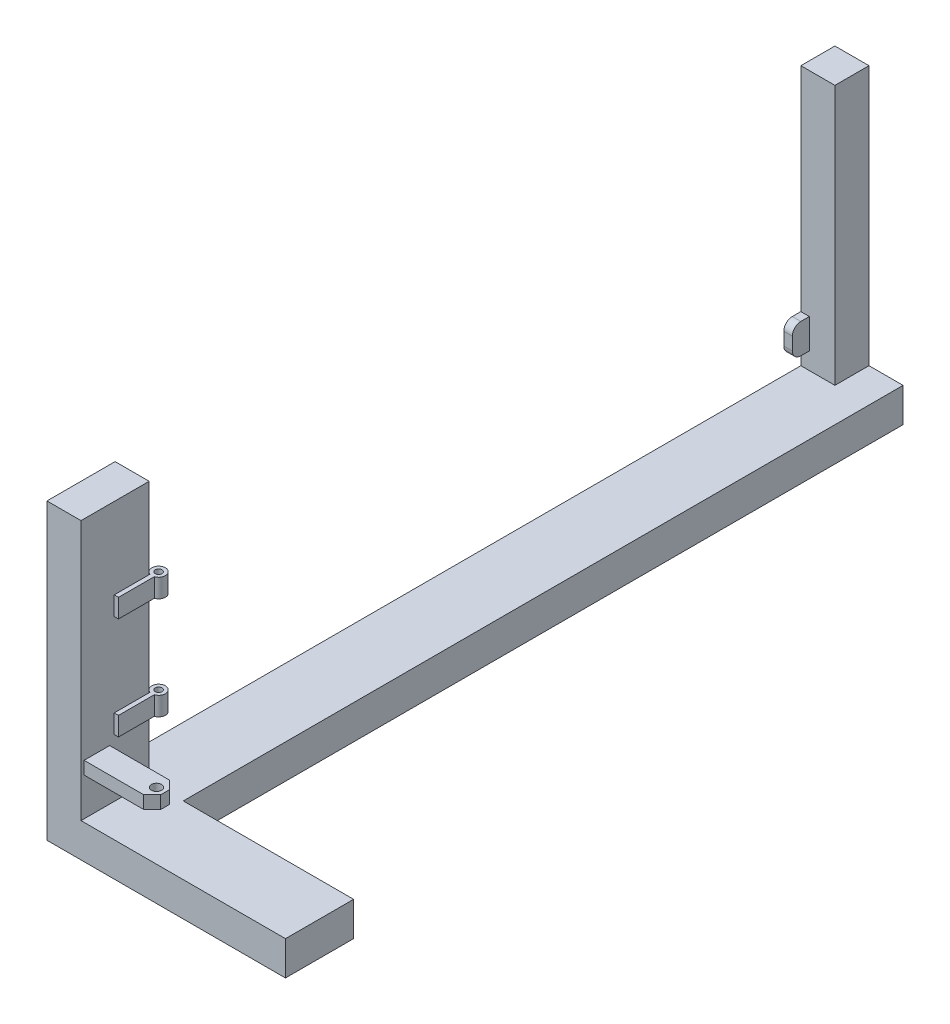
ISO-10303-21;
HEADER;
FILE_DESCRIPTION(('STEP AP214'),'2;1');
FILE_NAME('part.step','',(''),(''),'','','');
FILE_SCHEMA(('AUTOMOTIVE_DESIGN { 1 0 10303 214 1 1 1 1 }'));
ENDSEC;
DATA;
#1=APPLICATION_CONTEXT('core data for automotive mechanical design processes');
#2=APPLICATION_PROTOCOL_DEFINITION('international standard','automotive_design',2000,#1);
#3=PRODUCT_CONTEXT('',#1,'mechanical');
#4=PRODUCT('Part','Part','',(#3));
#5=PRODUCT_RELATED_PRODUCT_CATEGORY('part','',(#4));
#6=PRODUCT_DEFINITION_FORMATION('','',#4);
#7=PRODUCT_DEFINITION_CONTEXT('part definition',#1,'design');
#8=PRODUCT_DEFINITION('design','',#6,#7);
#9=PRODUCT_DEFINITION_SHAPE('','',#8);
#10=(LENGTH_UNIT() NAMED_UNIT(*) SI_UNIT(.MILLI.,.METRE.));
#11=(NAMED_UNIT(*) PLANE_ANGLE_UNIT() SI_UNIT($,.RADIAN.));
#12=(NAMED_UNIT(*) SI_UNIT($,.STERADIAN.) SOLID_ANGLE_UNIT());
#13=UNCERTAINTY_MEASURE_WITH_UNIT(LENGTH_MEASURE(1.E-05),#10,'distance_accuracy_value','');
#14=(GEOMETRIC_REPRESENTATION_CONTEXT(3) GLOBAL_UNCERTAINTY_ASSIGNED_CONTEXT((#13)) GLOBAL_UNIT_ASSIGNED_CONTEXT((#10,
#11,#12)) REPRESENTATION_CONTEXT('',''));
#15=CARTESIAN_POINT('',(0.,0.,0.));
#16=DIRECTION('',(0.,0.,1.));
#17=DIRECTION('',(1.,0.,0.));
#18=AXIS2_PLACEMENT_3D('',#15,#16,#17);
#19=CARTESIAN_POINT('',(40.,345.,925.));
#20=DIRECTION('',(-1.,0.,0.));
#21=DIRECTION('',(0.,0.,1.));
#22=AXIS2_PLACEMENT_3D('',#19,#20,#21);
#23=PLANE('',#22);
#24=DIRECTION('',(0.,0.,-1.));
#25=VECTOR('',#24,1.);
#26=CARTESIAN_POINT('',(40.,108.,886.));
#27=LINE('',#26,#25);
#28=CARTESIAN_POINT('',(40.,108.,886.));
#29=VERTEX_POINT('',#28);
#30=CARTESIAN_POINT('',(40.,108.,845.));
#31=VERTEX_POINT('',#30);
#32=EDGE_CURVE('E336',#29,#31,#27,.T.);
#33=ORIENTED_EDGE('',*,*,#32,.F.);
#34=DIRECTION('',(0.,-1.,0.));
#35=VECTOR('',#34,1.);
#36=CARTESIAN_POINT('',(40.,130.,886.));
#37=LINE('',#36,#35);
#38=CARTESIAN_POINT('',(40.,130.,886.));
#39=VERTEX_POINT('',#38);
#40=EDGE_CURVE('E332',#39,#29,#37,.T.);
#41=ORIENTED_EDGE('',*,*,#40,.F.);
#42=DIRECTION('',(0.,0.,1.));
#43=VECTOR('',#42,1.);
#44=CARTESIAN_POINT('',(40.,130.,886.));
#45=LINE('',#44,#43);
#46=CARTESIAN_POINT('',(40.,130.,845.));
#47=VERTEX_POINT('',#46);
#48=EDGE_CURVE('E340',#47,#39,#45,.T.);
#49=ORIENTED_EDGE('',*,*,#48,.F.);
#50=DIRECTION('',(0.,-1.,0.));
#51=VECTOR('',#50,1.);
#52=CARTESIAN_POINT('',(40.,345.,845.));
#53=LINE('',#52,#51);
#54=CARTESIAN_POINT('',(40.,228.,845.));
#55=VERTEX_POINT('',#54);
#56=EDGE_CURVE('E596',#55,#47,#53,.T.);
#57=ORIENTED_EDGE('',*,*,#56,.F.);
#58=DIRECTION('',(0.,0.,-1.));
#59=VECTOR('',#58,1.);
#60=CARTESIAN_POINT('',(40.,228.,886.));
#61=LINE('',#60,#59);
#62=CARTESIAN_POINT('',(40.,228.,886.));
#63=VERTEX_POINT('',#62);
#64=EDGE_CURVE('E364',#63,#55,#61,.T.);
#65=ORIENTED_EDGE('',*,*,#64,.F.);
#66=DIRECTION('',(0.,-1.,0.));
#67=VECTOR('',#66,1.);
#68=CARTESIAN_POINT('',(40.,250.,886.));
#69=LINE('',#68,#67);
#70=CARTESIAN_POINT('',(40.,250.,886.));
#71=VERTEX_POINT('',#70);
#72=EDGE_CURVE('E360',#71,#63,#69,.T.);
#73=ORIENTED_EDGE('',*,*,#72,.F.);
#74=DIRECTION('',(0.,0.,1.));
#75=VECTOR('',#74,1.);
#76=CARTESIAN_POINT('',(40.,250.,886.));
#77=LINE('',#76,#75);
#78=CARTESIAN_POINT('',(40.,250.,845.));
#79=VERTEX_POINT('',#78);
#80=EDGE_CURVE('E368',#79,#71,#77,.T.);
#81=ORIENTED_EDGE('',*,*,#80,.F.);
#82=CARTESIAN_POINT('',(40.,345.,845.));
#83=VERTEX_POINT('',#82);
#84=EDGE_CURVE('E583',#83,#79,#53,.T.);
#85=ORIENTED_EDGE('',*,*,#84,.F.);
#86=DIRECTION('',(0.,0.,-1.));
#87=VECTOR('',#86,1.);
#88=CARTESIAN_POINT('',(40.,345.,925.));
#89=LINE('',#88,#87);
#90=CARTESIAN_POINT('',(40.,345.,925.));
#91=VERTEX_POINT('',#90);
#92=EDGE_CURVE('E670',#91,#83,#89,.T.);
#93=ORIENTED_EDGE('',*,*,#92,.F.);
#94=DIRECTION('',(0.,-1.,0.));
#95=VECTOR('',#94,1.);
#96=CARTESIAN_POINT('',(40.,345.,925.));
#97=LINE('',#96,#95);
#98=CARTESIAN_POINT('',(40.,40.,925.));
#99=VERTEX_POINT('',#98);
#100=EDGE_CURVE('E580',#91,#99,#97,.T.);
#101=ORIENTED_EDGE('',*,*,#100,.T.);
#102=DIRECTION('',(0.,0.,-1.));
#103=VECTOR('',#102,1.);
#104=CARTESIAN_POINT('',(40.,40.,925.));
#105=LINE('',#104,#103);
#106=CARTESIAN_POINT('',(40.,40.,845.));
#107=VERTEX_POINT('',#106);
#108=EDGE_CURVE('E414',#99,#107,#105,.T.);
#109=ORIENTED_EDGE('',*,*,#108,.T.);
#110=EDGE_CURVE('E429',#31,#107,#53,.T.);
#111=ORIENTED_EDGE('',*,*,#110,.F.);
#112=EDGE_LOOP('',(#33,#41,#49,#57,#65,#73,#81,#85,#93,#101,#109,#111));
#113=FACE_BOUND('',#112,.T.);
#114=DIRECTION('',(0.,-1.,0.));
#115=VECTOR('',#114,1.);
#116=CARTESIAN_POINT('',(40.,99.5,921.400657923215));
#117=LINE('',#116,#115);
#118=CARTESIAN_POINT('',(40.,99.5,921.400657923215));
#119=VERTEX_POINT('',#118);
#120=CARTESIAN_POINT('',(40.,84.5,921.400657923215));
#121=VERTEX_POINT('',#120);
#122=EDGE_CURVE('E255',#119,#121,#117,.T.);
#123=ORIENTED_EDGE('',*,*,#122,.F.);
#124=DIRECTION('',(0.,0.,1.));
#125=VECTOR('',#124,1.);
#126=CARTESIAN_POINT('',(40.,99.5,921.400657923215));
#127=LINE('',#126,#125);
#128=CARTESIAN_POINT('',(40.,99.5,891.400657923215));
#129=VERTEX_POINT('',#128);
#130=EDGE_CURVE('E265',#129,#119,#127,.T.);
#131=ORIENTED_EDGE('',*,*,#130,.F.);
#132=DIRECTION('',(0.,1.,0.));
#133=VECTOR('',#132,1.);
#134=CARTESIAN_POINT('',(40.,99.5,891.400657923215));
#135=LINE('',#134,#133);
#136=CARTESIAN_POINT('',(40.,84.5,891.400657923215));
#137=VERTEX_POINT('',#136);
#138=EDGE_CURVE('E273',#137,#129,#135,.T.);
#139=ORIENTED_EDGE('',*,*,#138,.F.);
#140=DIRECTION('',(0.,0.,-1.));
#141=VECTOR('',#140,1.);
#142=CARTESIAN_POINT('',(40.,84.5,921.400657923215));
#143=LINE('',#142,#141);
#144=EDGE_CURVE('E268',#121,#137,#143,.T.);
#145=ORIENTED_EDGE('',*,*,#144,.F.);
#146=EDGE_LOOP('',(#123,#131,#139,#145));
#147=FACE_BOUND('',#146,.T.);
#148=ADVANCED_FACE('F33',(#113,#147),#23,.F.);
#149=CARTESIAN_POINT('',(0.,345.,40.));
#150=DIRECTION('',(0.,0.,-1.));
#151=DIRECTION('',(-1.,0.,0.));
#152=AXIS2_PLACEMENT_3D('',#149,#150,#151);
#153=PLANE('',#152);
#154=DIRECTION('',(1.,0.,0.));
#155=VECTOR('',#154,1.);
#156=CARTESIAN_POINT('',(0.,60.,40.));
#157=LINE('',#156,#155);
#158=CARTESIAN_POINT('',(0.,60.,40.));
#159=VERTEX_POINT('',#158);
#160=CARTESIAN_POINT('',(10.,59.9999999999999,40.));
#161=VERTEX_POINT('',#160);
#162=EDGE_CURVE('E287',#159,#161,#157,.T.);
#163=ORIENTED_EDGE('',*,*,#162,.F.);
#164=DIRECTION('',(0.,-1.,0.));
#165=VECTOR('',#164,1.);
#166=CARTESIAN_POINT('',(0.,345.,40.));
#167=LINE('',#166,#165);
#168=CARTESIAN_POINT('',(0.,40.,40.0000000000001));
#169=VERTEX_POINT('',#168);
#170=EDGE_CURVE('E410',#159,#169,#167,.T.);
#171=ORIENTED_EDGE('',*,*,#170,.T.);
#172=DIRECTION('',(1.,0.,0.));
#173=VECTOR('',#172,1.);
#174=CARTESIAN_POINT('',(0.,40.,40.));
#175=LINE('',#174,#173);
#176=CARTESIAN_POINT('',(40.,40.,39.9999999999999));
#177=VERTEX_POINT('',#176);
#178=EDGE_CURVE('E388',#169,#177,#175,.T.);
#179=ORIENTED_EDGE('',*,*,#178,.T.);
#180=DIRECTION('',(0.,-1.,0.));
#181=VECTOR('',#180,1.);
#182=CARTESIAN_POINT('',(40.,345.,40.));
#183=LINE('',#182,#181);
#184=CARTESIAN_POINT('',(40.,345.,40.));
#185=VERTEX_POINT('',#184);
#186=EDGE_CURVE('E407',#185,#177,#183,.T.);
#187=ORIENTED_EDGE('',*,*,#186,.F.);
#188=DIRECTION('',(1.,0.,0.));
#189=VECTOR('',#188,1.);
#190=CARTESIAN_POINT('',(0.,345.,40.));
#191=LINE('',#190,#189);
#192=CARTESIAN_POINT('',(0.,345.,40.));
#193=VERTEX_POINT('',#192);
#194=EDGE_CURVE('E397',#193,#185,#191,.T.);
#195=ORIENTED_EDGE('',*,*,#194,.F.);
#196=CARTESIAN_POINT('',(0.,95.,40.));
#197=VERTEX_POINT('',#196);
#198=EDGE_CURVE('E411',#193,#197,#167,.T.);
#199=ORIENTED_EDGE('',*,*,#198,.T.);
#200=DIRECTION('',(-1.,0.,0.));
#201=VECTOR('',#200,1.);
#202=CARTESIAN_POINT('',(0.,95.,40.));
#203=LINE('',#202,#201);
#204=CARTESIAN_POINT('',(10.,95.,40.));
#205=VERTEX_POINT('',#204);
#206=EDGE_CURVE('E293',#205,#197,#203,.T.);
#207=ORIENTED_EDGE('',*,*,#206,.F.);
#208=DIRECTION('',(0.,1.,0.));
#209=VECTOR('',#208,1.);
#210=CARTESIAN_POINT('',(10.,60.,40.));
#211=LINE('',#210,#209);
#212=EDGE_CURVE('E290',#161,#205,#211,.T.);
#213=ORIENTED_EDGE('',*,*,#212,.F.);
#214=EDGE_LOOP('',(#163,#171,#179,#187,#195,#199,#207,#213));
#215=FACE_BOUND('',#214,.T.);
#216=ADVANCED_FACE('F498',(#215),#153,.F.);
#217=CARTESIAN_POINT('',(0.,40.,925.));
#218=DIRECTION('',(0.,-1.,0.));
#219=DIRECTION('',(1.,0.,0.));
#220=AXIS2_PLACEMENT_3D('',#217,#218,#219);
#221=PLANE('',#220);
#222=ORIENTED_EDGE('',*,*,#178,.F.);
#223=DIRECTION('',(0.,0.,-1.));
#224=VECTOR('',#223,1.);
#225=CARTESIAN_POINT('',(0.,40.,925.));
#226=LINE('',#225,#224);
#227=CARTESIAN_POINT('',(0.,40.,845.));
#228=VERTEX_POINT('',#227);
#229=EDGE_CURVE('E575',#228,#169,#226,.T.);
#230=ORIENTED_EDGE('',*,*,#229,.F.);
#231=DIRECTION('',(-1.,0.,0.));
#232=VECTOR('',#231,1.);
#233=CARTESIAN_POINT('',(0.,40.,845.));
#234=LINE('',#233,#232);
#235=EDGE_CURVE('E420',#107,#228,#234,.T.);
#236=ORIENTED_EDGE('',*,*,#235,.F.);
#237=ORIENTED_EDGE('',*,*,#108,.F.);
#238=DIRECTION('',(-1.,0.,0.));
#239=VECTOR('',#238,1.);
#240=CARTESIAN_POINT('',(0.,40.,925.));
#241=LINE('',#240,#239);
#242=CARTESIAN_POINT('',(280.,40.,925.));
#243=VERTEX_POINT('',#242);
#244=EDGE_CURVE('E566',#243,#99,#241,.T.);
#245=ORIENTED_EDGE('',*,*,#244,.F.);
#246=DIRECTION('',(0.,0.,1.));
#247=VECTOR('',#246,1.);
#248=CARTESIAN_POINT('',(280.,40.,925.));
#249=LINE('',#248,#247);
#250=CARTESIAN_POINT('',(280.,40.,845.));
#251=VERTEX_POINT('',#250);
#252=EDGE_CURVE('E643',#251,#243,#249,.T.);
#253=ORIENTED_EDGE('',*,*,#252,.F.);
#254=DIRECTION('',(-1.,0.,0.));
#255=VECTOR('',#254,1.);
#256=CARTESIAN_POINT('',(280.,40.,845.));
#257=LINE('',#256,#255);
#258=CARTESIAN_POINT('',(80.,40.,845.));
#259=VERTEX_POINT('',#258);
#260=EDGE_CURVE('E644',#251,#259,#257,.T.);
#261=ORIENTED_EDGE('',*,*,#260,.T.);
#262=DIRECTION('',(0.,0.,-1.));
#263=VECTOR('',#262,1.);
#264=CARTESIAN_POINT('',(80.,40.,925.));
#265=LINE('',#264,#263);
#266=CARTESIAN_POINT('',(80.,40.,0.));
#267=VERTEX_POINT('',#266);
#268=EDGE_CURVE('E657',#259,#267,#265,.T.);
#269=ORIENTED_EDGE('',*,*,#268,.T.);
#270=DIRECTION('',(-1.,0.,0.));
#271=VECTOR('',#270,1.);
#272=CARTESIAN_POINT('',(0.,40.,0.));
#273=LINE('',#272,#271);
#274=CARTESIAN_POINT('',(40.,40.,0.));
#275=VERTEX_POINT('',#274);
#276=EDGE_CURVE('E556',#267,#275,#273,.T.);
#277=ORIENTED_EDGE('',*,*,#276,.T.);
#278=DIRECTION('',(0.,0.,-1.));
#279=VECTOR('',#278,1.);
#280=CARTESIAN_POINT('',(40.,40.,0.));
#281=LINE('',#280,#279);
#282=EDGE_CURVE('E391',#177,#275,#281,.T.);
#283=ORIENTED_EDGE('',*,*,#282,.F.);
#284=EDGE_LOOP('',(#222,#230,#236,#237,#245,#253,#261,#269,#277,#283));
#285=FACE_BOUND('',#284,.T.);
#286=ADVANCED_FACE('F504',(#285),#221,.F.);
#287=CARTESIAN_POINT('',(80.,0.,925.));
#288=DIRECTION('',(-1.,0.,0.));
#289=DIRECTION('',(0.,0.,1.));
#290=AXIS2_PLACEMENT_3D('',#287,#288,#289);
#291=PLANE('',#290);
#292=DIRECTION('',(0.,1.,0.));
#293=VECTOR('',#292,1.);
#294=CARTESIAN_POINT('',(80.,40.,845.));
#295=LINE('',#294,#293);
#296=CARTESIAN_POINT('',(80.,0.,845.));
#297=VERTEX_POINT('',#296);
#298=EDGE_CURVE('E582',#297,#259,#295,.T.);
#299=ORIENTED_EDGE('',*,*,#298,.F.);
#300=DIRECTION('',(0.,0.,-1.));
#301=VECTOR('',#300,1.);
#302=CARTESIAN_POINT('',(80.,0.,925.));
#303=LINE('',#302,#301);
#304=CARTESIAN_POINT('',(80.,0.,0.));
#305=VERTEX_POINT('',#304);
#306=EDGE_CURVE('E547',#297,#305,#303,.T.);
#307=ORIENTED_EDGE('',*,*,#306,.T.);
#308=DIRECTION('',(0.,1.,0.));
#309=VECTOR('',#308,1.);
#310=CARTESIAN_POINT('',(80.,0.,0.));
#311=LINE('',#310,#309);
#312=EDGE_CURVE('E551',#305,#267,#311,.T.);
#313=ORIENTED_EDGE('',*,*,#312,.T.);
#314=ORIENTED_EDGE('',*,*,#268,.F.);
#315=EDGE_LOOP('',(#299,#307,#313,#314));
#316=FACE_BOUND('',#315,.T.);
#317=ADVANCED_FACE('F531',(#316),#291,.F.);
#318=CARTESIAN_POINT('',(0.,0.,925.));
#319=DIRECTION('',(1.,0.,0.));
#320=DIRECTION('',(0.,0.,-1.));
#321=AXIS2_PLACEMENT_3D('',#318,#319,#320);
#322=PLANE('',#321);
#323=DIRECTION('',(0.,-1.,0.));
#324=VECTOR('',#323,1.);
#325=CARTESIAN_POINT('',(0.,60.,60.));
#326=LINE('',#325,#324);
#327=CARTESIAN_POINT('',(0.,85.,60.));
#328=VERTEX_POINT('',#327);
#329=CARTESIAN_POINT('',(0.,70.,60.));
#330=VERTEX_POINT('',#329);
#331=EDGE_CURVE('E296',#328,#330,#326,.T.);
#332=ORIENTED_EDGE('',*,*,#331,.F.);
#333=CARTESIAN_POINT('',(0.,85.,50.));
#334=DIRECTION('',(1.,0.,0.));
#335=DIRECTION('',(0.,0.,-1.));
#336=AXIS2_PLACEMENT_3D('',#333,#334,#335);
#337=CIRCLE('',#336,10.);
#338=CARTESIAN_POINT('',(0.,95.,50.));
#339=VERTEX_POINT('',#338);
#340=EDGE_CURVE('E442',#328,#339,#337,.F.);
#341=ORIENTED_EDGE('',*,*,#340,.T.);
#342=DIRECTION('',(0.,0.,-1.));
#343=VECTOR('',#342,1.);
#344=CARTESIAN_POINT('',(0.,95.,60.));
#345=LINE('',#344,#343);
#346=EDGE_CURVE('E302',#339,#197,#345,.T.);
#347=ORIENTED_EDGE('',*,*,#346,.T.);
#348=ORIENTED_EDGE('',*,*,#198,.F.);
#349=DIRECTION('',(0.,0.,1.));
#350=VECTOR('',#349,1.);
#351=CARTESIAN_POINT('',(0.,345.,0.));
#352=LINE('',#351,#350);
#353=CARTESIAN_POINT('',(0.,345.,0.));
#354=VERTEX_POINT('',#353);
#355=EDGE_CURVE('E394',#354,#193,#352,.T.);
#356=ORIENTED_EDGE('',*,*,#355,.F.);
#357=DIRECTION('',(0.,-1.,0.));
#358=VECTOR('',#357,1.);
#359=CARTESIAN_POINT('',(0.,0.,0.));
#360=LINE('',#359,#358);
#361=CARTESIAN_POINT('',(0.,0.,0.));
#362=VERTEX_POINT('',#361);
#363=EDGE_CURVE('E552',#354,#362,#360,.T.);
#364=ORIENTED_EDGE('',*,*,#363,.T.);
#365=DIRECTION('',(0.,0.,-1.));
#366=VECTOR('',#365,1.);
#367=CARTESIAN_POINT('',(0.,0.,925.));
#368=LINE('',#367,#366);
#369=CARTESIAN_POINT('',(0.,0.,925.));
#370=VERTEX_POINT('',#369);
#371=EDGE_CURVE('E437',#370,#362,#368,.T.);
#372=ORIENTED_EDGE('',*,*,#371,.F.);
#373=DIRECTION('',(0.,-1.,0.));
#374=VECTOR('',#373,1.);
#375=CARTESIAN_POINT('',(0.,0.,925.));
#376=LINE('',#375,#374);
#377=CARTESIAN_POINT('',(0.,345.,925.));
#378=VERTEX_POINT('',#377);
#379=EDGE_CURVE('E558',#378,#370,#376,.T.);
#380=ORIENTED_EDGE('',*,*,#379,.F.);
#381=DIRECTION('',(0.,0.,1.));
#382=VECTOR('',#381,1.);
#383=CARTESIAN_POINT('',(0.,345.,925.));
#384=LINE('',#383,#382);
#385=CARTESIAN_POINT('',(0.,345.,845.));
#386=VERTEX_POINT('',#385);
#387=EDGE_CURVE('E417',#386,#378,#384,.T.);
#388=ORIENTED_EDGE('',*,*,#387,.F.);
#389=DIRECTION('',(0.,-1.,0.));
#390=VECTOR('',#389,1.);
#391=CARTESIAN_POINT('',(0.,345.,845.));
#392=LINE('',#391,#390);
#393=EDGE_CURVE('E426',#386,#228,#392,.T.);
#394=ORIENTED_EDGE('',*,*,#393,.T.);
#395=ORIENTED_EDGE('',*,*,#229,.T.);
#396=ORIENTED_EDGE('',*,*,#170,.F.);
#397=DIRECTION('',(0.,0.,-1.));
#398=VECTOR('',#397,1.);
#399=CARTESIAN_POINT('',(0.,60.,60.));
#400=LINE('',#399,#398);
#401=CARTESIAN_POINT('',(0.,60.,50.));
#402=VERTEX_POINT('',#401);
#403=EDGE_CURVE('E308',#402,#159,#400,.T.);
#404=ORIENTED_EDGE('',*,*,#403,.F.);
#405=CARTESIAN_POINT('',(0.,70.,50.));
#406=DIRECTION('',(1.,0.,0.));
#407=DIRECTION('',(0.,0.,-1.));
#408=AXIS2_PLACEMENT_3D('',#405,#406,#407);
#409=CIRCLE('',#408,10.);
#410=EDGE_CURVE('E440',#402,#330,#409,.F.);
#411=ORIENTED_EDGE('',*,*,#410,.T.);
#412=EDGE_LOOP('',(#332,#341,#347,#348,#356,#364,#372,#380,#388,#394,#395,#396,#404,#411));
#413=FACE_BOUND('',#412,.T.);
#414=ADVANCED_FACE('F35',(#413),#322,.F.);
#415=CARTESIAN_POINT('',(0.,0.,925.));
#416=DIRECTION('',(0.,1.,0.));
#417=DIRECTION('',(-1.,0.,0.));
#418=AXIS2_PLACEMENT_3D('',#415,#416,#417);
#419=PLANE('',#418);
#420=DIRECTION('',(1.,0.,0.));
#421=VECTOR('',#420,1.);
#422=CARTESIAN_POINT('',(0.,0.,0.));
#423=LINE('',#422,#421);
#424=EDGE_CURVE('E544',#362,#305,#423,.T.);
#425=ORIENTED_EDGE('',*,*,#424,.T.);
#426=ORIENTED_EDGE('',*,*,#306,.F.);
#427=DIRECTION('',(-1.,0.,0.));
#428=VECTOR('',#427,1.);
#429=CARTESIAN_POINT('',(280.,0.,845.));
#430=LINE('',#429,#428);
#431=CARTESIAN_POINT('',(280.,0.,845.));
#432=VERTEX_POINT('',#431);
#433=EDGE_CURVE('E645',#432,#297,#430,.T.);
#434=ORIENTED_EDGE('',*,*,#433,.F.);
#435=DIRECTION('',(0.,0.,-1.));
#436=VECTOR('',#435,1.);
#437=CARTESIAN_POINT('',(280.,0.,925.));
#438=LINE('',#437,#436);
#439=CARTESIAN_POINT('',(280.,0.,925.));
#440=VERTEX_POINT('',#439);
#441=EDGE_CURVE('E636',#440,#432,#438,.T.);
#442=ORIENTED_EDGE('',*,*,#441,.F.);
#443=DIRECTION('',(1.,0.,0.));
#444=VECTOR('',#443,1.);
#445=CARTESIAN_POINT('',(0.,0.,925.));
#446=LINE('',#445,#444);
#447=EDGE_CURVE('E564',#370,#440,#446,.T.);
#448=ORIENTED_EDGE('',*,*,#447,.F.);
#449=ORIENTED_EDGE('',*,*,#371,.T.);
#450=EDGE_LOOP('',(#425,#426,#434,#442,#448,#449));
#451=FACE_BOUND('',#450,.T.);
#452=ADVANCED_FACE('F527',(#451),#419,.F.);
#453=CARTESIAN_POINT('',(0.,40.,925.));
#454=DIRECTION('',(0.,0.,-1.));
#455=DIRECTION('',(-1.,0.,0.));
#456=AXIS2_PLACEMENT_3D('',#453,#454,#455);
#457=PLANE('',#456);
#458=ORIENTED_EDGE('',*,*,#379,.T.);
#459=ORIENTED_EDGE('',*,*,#447,.T.);
#460=DIRECTION('',(0.,-1.,0.));
#461=VECTOR('',#460,1.);
#462=CARTESIAN_POINT('',(280.,40.,925.));
#463=LINE('',#462,#461);
#464=EDGE_CURVE('E587',#243,#440,#463,.T.);
#465=ORIENTED_EDGE('',*,*,#464,.F.);
#466=ORIENTED_EDGE('',*,*,#244,.T.);
#467=ORIENTED_EDGE('',*,*,#100,.F.);
#468=DIRECTION('',(1.,0.,0.));
#469=VECTOR('',#468,1.);
#470=CARTESIAN_POINT('',(0.,345.,925.));
#471=LINE('',#470,#469);
#472=EDGE_CURVE('E669',#378,#91,#471,.T.);
#473=ORIENTED_EDGE('',*,*,#472,.F.);
#474=EDGE_LOOP('',(#458,#459,#465,#466,#467,#473));
#475=FACE_BOUND('',#474,.T.);
#476=ADVANCED_FACE('F523',(#475),#457,.F.);
#477=CARTESIAN_POINT('',(0.,40.,0.));
#478=DIRECTION('',(0.,0.,-1.));
#479=DIRECTION('',(-1.,0.,0.));
#480=AXIS2_PLACEMENT_3D('',#477,#478,#479);
#481=PLANE('',#480);
#482=ORIENTED_EDGE('',*,*,#363,.F.);
#483=DIRECTION('',(-1.,0.,0.));
#484=VECTOR('',#483,1.);
#485=CARTESIAN_POINT('',(0.,345.,0.));
#486=LINE('',#485,#484);
#487=CARTESIAN_POINT('',(40.,345.,0.));
#488=VERTEX_POINT('',#487);
#489=EDGE_CURVE('E401',#488,#354,#486,.T.);
#490=ORIENTED_EDGE('',*,*,#489,.F.);
#491=DIRECTION('',(0.,-1.,0.));
#492=VECTOR('',#491,1.);
#493=CARTESIAN_POINT('',(40.,345.,0.));
#494=LINE('',#493,#492);
#495=EDGE_CURVE('E404',#488,#275,#494,.T.);
#496=ORIENTED_EDGE('',*,*,#495,.T.);
#497=ORIENTED_EDGE('',*,*,#276,.F.);
#498=ORIENTED_EDGE('',*,*,#312,.F.);
#499=ORIENTED_EDGE('',*,*,#424,.F.);
#500=EDGE_LOOP('',(#482,#490,#496,#497,#498,#499));
#501=FACE_BOUND('',#500,.T.);
#502=ADVANCED_FACE('F519',(#501),#481,.T.);
#503=CARTESIAN_POINT('',(280.,40.,845.));
#504=DIRECTION('',(0.,0.,1.));
#505=DIRECTION('',(1.,0.,0.));
#506=AXIS2_PLACEMENT_3D('',#503,#504,#505);
#507=PLANE('',#506);
#508=ORIENTED_EDGE('',*,*,#298,.T.);
#509=ORIENTED_EDGE('',*,*,#260,.F.);
#510=DIRECTION('',(0.,1.,0.));
#511=VECTOR('',#510,1.);
#512=CARTESIAN_POINT('',(280.,40.,845.));
#513=LINE('',#512,#511);
#514=EDGE_CURVE('E638',#432,#251,#513,.T.);
#515=ORIENTED_EDGE('',*,*,#514,.F.);
#516=ORIENTED_EDGE('',*,*,#433,.T.);
#517=EDGE_LOOP('',(#508,#509,#515,#516));
#518=FACE_BOUND('',#517,.T.);
#519=ADVANCED_FACE('F515',(#518),#507,.F.);
#520=CARTESIAN_POINT('',(280.,0.,925.));
#521=DIRECTION('',(1.,0.,0.));
#522=DIRECTION('',(0.,0.,-1.));
#523=AXIS2_PLACEMENT_3D('',#520,#521,#522);
#524=PLANE('',#523);
#525=ORIENTED_EDGE('',*,*,#464,.T.);
#526=ORIENTED_EDGE('',*,*,#441,.T.);
#527=ORIENTED_EDGE('',*,*,#514,.T.);
#528=ORIENTED_EDGE('',*,*,#252,.T.);
#529=EDGE_LOOP('',(#525,#526,#527,#528));
#530=FACE_BOUND('',#529,.T.);
#531=ADVANCED_FACE('F512',(#530),#524,.T.);
#532=CARTESIAN_POINT('',(0.,345.,845.));
#533=DIRECTION('',(0.,0.,1.));
#534=DIRECTION('',(1.,0.,0.));
#535=AXIS2_PLACEMENT_3D('',#532,#533,#534);
#536=PLANE('',#535);
#537=ORIENTED_EDGE('',*,*,#235,.T.);
#538=ORIENTED_EDGE('',*,*,#393,.F.);
#539=DIRECTION('',(-1.,0.,0.));
#540=VECTOR('',#539,1.);
#541=CARTESIAN_POINT('',(0.,345.,845.));
#542=LINE('',#541,#540);
#543=EDGE_CURVE('E430',#83,#386,#542,.T.);
#544=ORIENTED_EDGE('',*,*,#543,.F.);
#545=ORIENTED_EDGE('',*,*,#84,.T.);
#546=EDGE_CURVE('E590',#79,#55,#53,.T.);
#547=ORIENTED_EDGE('',*,*,#546,.T.);
#548=ORIENTED_EDGE('',*,*,#56,.T.);
#549=EDGE_CURVE('E599',#47,#31,#53,.T.);
#550=ORIENTED_EDGE('',*,*,#549,.T.);
#551=ORIENTED_EDGE('',*,*,#110,.T.);
#552=EDGE_LOOP('',(#537,#538,#544,#545,#547,#548,#550,#551));
#553=FACE_BOUND('',#552,.T.);
#554=ADVANCED_FACE('F510',(#553),#536,.F.);
#555=CARTESIAN_POINT('',(0.,345.,845.));
#556=DIRECTION('',(0.,-1.,0.));
#557=DIRECTION('',(1.,0.,0.));
#558=AXIS2_PLACEMENT_3D('',#555,#556,#557);
#559=PLANE('',#558);
#560=ORIENTED_EDGE('',*,*,#387,.T.);
#561=ORIENTED_EDGE('',*,*,#472,.T.);
#562=ORIENTED_EDGE('',*,*,#92,.T.);
#563=ORIENTED_EDGE('',*,*,#543,.T.);
#564=EDGE_LOOP('',(#560,#561,#562,#563));
#565=FACE_BOUND('',#564,.T.);
#566=ADVANCED_FACE('F672',(#565),#559,.F.);
#567=CARTESIAN_POINT('',(40.,345.,0.));
#568=DIRECTION('',(-1.,0.,0.));
#569=DIRECTION('',(0.,-1.,0.));
#570=AXIS2_PLACEMENT_3D('',#567,#568,#569);
#571=PLANE('',#570);
#572=ORIENTED_EDGE('',*,*,#282,.T.);
#573=ORIENTED_EDGE('',*,*,#495,.F.);
#574=DIRECTION('',(0.,0.,-1.));
#575=VECTOR('',#574,1.);
#576=CARTESIAN_POINT('',(40.,345.,0.));
#577=LINE('',#576,#575);
#578=EDGE_CURVE('E399',#185,#488,#577,.T.);
#579=ORIENTED_EDGE('',*,*,#578,.F.);
#580=ORIENTED_EDGE('',*,*,#186,.T.);
#581=EDGE_LOOP('',(#572,#573,#579,#580));
#582=FACE_BOUND('',#581,.T.);
#583=ADVANCED_FACE('F732',(#582),#571,.F.);
#584=CARTESIAN_POINT('',(0.,345.,0.));
#585=DIRECTION('',(0.,1.,0.));
#586=DIRECTION('',(-1.,0.,0.));
#587=AXIS2_PLACEMENT_3D('',#584,#585,#586);
#588=PLANE('',#587);
#589=ORIENTED_EDGE('',*,*,#355,.T.);
#590=ORIENTED_EDGE('',*,*,#194,.T.);
#591=ORIENTED_EDGE('',*,*,#578,.T.);
#592=ORIENTED_EDGE('',*,*,#489,.T.);
#593=EDGE_LOOP('',(#589,#590,#591,#592));
#594=FACE_BOUND('',#593,.T.);
#595=ADVANCED_FACE('F721',(#594),#588,.T.);
#596=CARTESIAN_POINT('',(40.,228.,886.));
#597=DIRECTION('',(1.,0.,0.));
#598=DIRECTION('',(0.,0.,-1.));
#599=AXIS2_PLACEMENT_3D('',#596,#597,#598);
#600=PLANE('',#599);
#601=CARTESIAN_POINT('',(39.9999999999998,228.,844.));
#602=VERTEX_POINT('',#601);
#603=EDGE_CURVE('E363',#55,#602,#61,.T.);
#604=ORIENTED_EDGE('',*,*,#603,.F.);
#605=ORIENTED_EDGE('',*,*,#546,.F.);
#606=CARTESIAN_POINT('',(40.0000000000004,250.,844.));
#607=VERTEX_POINT('',#606);
#608=EDGE_CURVE('E369',#607,#79,#77,.T.);
#609=ORIENTED_EDGE('',*,*,#608,.F.);
#610=DIRECTION('',(0.,1.,0.));
#611=VECTOR('',#610,1.);
#612=CARTESIAN_POINT('',(40.,250.,844.));
#613=LINE('',#612,#611);
#614=EDGE_CURVE('E366',#602,#607,#613,.T.);
#615=ORIENTED_EDGE('',*,*,#614,.F.);
#616=EDGE_LOOP('',(#604,#605,#609,#615));
#617=FACE_BOUND('',#616,.T.);
#618=ADVANCED_FACE('F690',(#617),#600,.F.);
#619=CARTESIAN_POINT('',(45.,250.,886.));
#620=DIRECTION('',(0.,0.,-1.));
#621=DIRECTION('',(-1.,0.,0.));
#622=AXIS2_PLACEMENT_3D('',#619,#620,#621);
#623=PLANE('',#622);
#624=ORIENTED_EDGE('',*,*,#72,.T.);
#625=DIRECTION('',(-1.,0.,0.));
#626=VECTOR('',#625,1.);
#627=CARTESIAN_POINT('',(45.,228.,886.));
#628=LINE('',#627,#626);
#629=CARTESIAN_POINT('',(45.,228.,886.));
#630=VERTEX_POINT('',#629);
#631=EDGE_CURVE('E386',#630,#63,#628,.T.);
#632=ORIENTED_EDGE('',*,*,#631,.F.);
#633=DIRECTION('',(0.,-1.,0.));
#634=VECTOR('',#633,1.);
#635=CARTESIAN_POINT('',(45.,250.,886.));
#636=LINE('',#635,#634);
#637=CARTESIAN_POINT('',(45.,250.,886.));
#638=VERTEX_POINT('',#637);
#639=EDGE_CURVE('E372',#638,#630,#636,.T.);
#640=ORIENTED_EDGE('',*,*,#639,.F.);
#641=DIRECTION('',(-1.,0.,0.));
#642=VECTOR('',#641,1.);
#643=CARTESIAN_POINT('',(45.,250.,886.));
#644=LINE('',#643,#642);
#645=EDGE_CURVE('E383',#638,#71,#644,.T.);
#646=ORIENTED_EDGE('',*,*,#645,.T.);
#647=EDGE_LOOP('',(#624,#632,#640,#646));
#648=FACE_BOUND('',#647,.T.);
#649=ADVANCED_FACE('F682',(#648),#623,.F.);
#650=CARTESIAN_POINT('',(45.,228.,886.));
#651=DIRECTION('',(0.,1.,0.));
#652=DIRECTION('',(-1.,0.,0.));
#653=AXIS2_PLACEMENT_3D('',#650,#651,#652);
#654=PLANE('',#653);
#655=ORIENTED_EDGE('',*,*,#603,.T.);
#656=CARTESIAN_POINT('',(42.5,228.,836.400657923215));
#657=DIRECTION('',(0.,1.,0.));
#658=DIRECTION('',(-1.,0.,0.));
#659=AXIS2_PLACEMENT_3D('',#656,#657,#658);
#660=CIRCLE('',#659,8.);
#661=CARTESIAN_POINT('',(45.,228.,844.));
#662=VERTEX_POINT('',#661);
#663=EDGE_CURVE('E330',#662,#602,#660,.T.);
#664=ORIENTED_EDGE('',*,*,#663,.F.);
#665=DIRECTION('',(0.,0.,-1.));
#666=VECTOR('',#665,1.);
#667=CARTESIAN_POINT('',(45.,228.,886.));
#668=LINE('',#667,#666);
#669=EDGE_CURVE('E375',#630,#662,#668,.T.);
#670=ORIENTED_EDGE('',*,*,#669,.F.);
#671=ORIENTED_EDGE('',*,*,#631,.T.);
#672=ORIENTED_EDGE('',*,*,#64,.T.);
#673=EDGE_LOOP('',(#655,#664,#670,#671,#672));
#674=FACE_BOUND('',#673,.T.);
#675=CARTESIAN_POINT('',(42.5,228.,836.400657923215));
#676=DIRECTION('',(0.,1.,0.));
#677=DIRECTION('',(-1.,0.,0.));
#678=AXIS2_PLACEMENT_3D('',#675,#676,#677);
#679=CIRCLE('',#678,4.00000000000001);
#680=CARTESIAN_POINT('',(38.5,228.,836.400657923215));
#681=VERTEX_POINT('',#680);
#682=EDGE_CURVE('E324',#681,#681,#679,.T.);
#683=ORIENTED_EDGE('',*,*,#682,.T.);
#684=EDGE_LOOP('',(#683));
#685=FACE_BOUND('',#684,.T.);
#686=ADVANCED_FACE('F694',(#674,#685),#654,.F.);
#687=CARTESIAN_POINT('',(45.,250.,886.));
#688=DIRECTION('',(0.,-1.,0.));
#689=DIRECTION('',(1.,0.,0.));
#690=AXIS2_PLACEMENT_3D('',#687,#688,#689);
#691=PLANE('',#690);
#692=DIRECTION('',(0.,0.,1.));
#693=VECTOR('',#692,1.);
#694=CARTESIAN_POINT('',(45.,250.,886.));
#695=LINE('',#694,#693);
#696=CARTESIAN_POINT('',(45.,250.,844.));
#697=VERTEX_POINT('',#696);
#698=EDGE_CURVE('E381',#697,#638,#695,.T.);
#699=ORIENTED_EDGE('',*,*,#698,.F.);
#700=CARTESIAN_POINT('',(42.5,250.,836.400657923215));
#701=DIRECTION('',(0.,1.,0.));
#702=DIRECTION('',(-1.,0.,0.));
#703=AXIS2_PLACEMENT_3D('',#700,#701,#702);
#704=CIRCLE('',#703,8.);
#705=EDGE_CURVE('E327',#697,#607,#704,.T.);
#706=ORIENTED_EDGE('',*,*,#705,.T.);
#707=ORIENTED_EDGE('',*,*,#608,.T.);
#708=ORIENTED_EDGE('',*,*,#80,.T.);
#709=ORIENTED_EDGE('',*,*,#645,.F.);
#710=EDGE_LOOP('',(#699,#706,#707,#708,#709));
#711=FACE_BOUND('',#710,.T.);
#712=CARTESIAN_POINT('',(42.5,250.,836.400657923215));
#713=DIRECTION('',(0.,1.,0.));
#714=DIRECTION('',(-1.,0.,0.));
#715=AXIS2_PLACEMENT_3D('',#712,#713,#714);
#716=CIRCLE('',#715,4.00000000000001);
#717=CARTESIAN_POINT('',(38.5,250.,836.400657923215));
#718=VERTEX_POINT('',#717);
#719=EDGE_CURVE('E321',#718,#718,#716,.T.);
#720=ORIENTED_EDGE('',*,*,#719,.F.);
#721=EDGE_LOOP('',(#720));
#722=FACE_BOUND('',#721,.T.);
#723=ADVANCED_FACE('F677',(#711,#722),#691,.F.);
#724=CARTESIAN_POINT('',(45.,228.,886.));
#725=DIRECTION('',(1.,0.,0.));
#726=DIRECTION('',(0.,0.,-1.));
#727=AXIS2_PLACEMENT_3D('',#724,#725,#726);
#728=PLANE('',#727);
#729=ORIENTED_EDGE('',*,*,#639,.T.);
#730=ORIENTED_EDGE('',*,*,#669,.T.);
#731=DIRECTION('',(0.,1.,0.));
#732=VECTOR('',#731,1.);
#733=CARTESIAN_POINT('',(45.,250.,844.));
#734=LINE('',#733,#732);
#735=EDGE_CURVE('E378',#662,#697,#734,.T.);
#736=ORIENTED_EDGE('',*,*,#735,.T.);
#737=ORIENTED_EDGE('',*,*,#698,.T.);
#738=EDGE_LOOP('',(#729,#730,#736,#737));
#739=FACE_BOUND('',#738,.T.);
#740=ADVANCED_FACE('F685',(#739),#728,.T.);
#741=CARTESIAN_POINT('',(40.,108.,886.));
#742=DIRECTION('',(1.,0.,0.));
#743=DIRECTION('',(0.,0.,-1.));
#744=AXIS2_PLACEMENT_3D('',#741,#742,#743);
#745=PLANE('',#744);
#746=CARTESIAN_POINT('',(40.0000000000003,108.,844.));
#747=VERTEX_POINT('',#746);
#748=EDGE_CURVE('E335',#31,#747,#27,.T.);
#749=ORIENTED_EDGE('',*,*,#748,.F.);
#750=ORIENTED_EDGE('',*,*,#549,.F.);
#751=CARTESIAN_POINT('',(40.0000000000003,130.,844.));
#752=VERTEX_POINT('',#751);
#753=EDGE_CURVE('E341',#752,#47,#45,.T.);
#754=ORIENTED_EDGE('',*,*,#753,.F.);
#755=DIRECTION('',(0.,1.,0.));
#756=VECTOR('',#755,1.);
#757=CARTESIAN_POINT('',(40.,130.,844.));
#758=LINE('',#757,#756);
#759=EDGE_CURVE('E338',#747,#752,#758,.T.);
#760=ORIENTED_EDGE('',*,*,#759,.F.);
#761=EDGE_LOOP('',(#749,#750,#754,#760));
#762=FACE_BOUND('',#761,.T.);
#763=ADVANCED_FACE('F625',(#762),#745,.F.);
#764=CARTESIAN_POINT('',(45.,130.,886.));
#765=DIRECTION('',(0.,0.,-1.));
#766=DIRECTION('',(-1.,0.,0.));
#767=AXIS2_PLACEMENT_3D('',#764,#765,#766);
#768=PLANE('',#767);
#769=ORIENTED_EDGE('',*,*,#40,.T.);
#770=DIRECTION('',(-1.,0.,0.));
#771=VECTOR('',#770,1.);
#772=CARTESIAN_POINT('',(45.,108.,886.));
#773=LINE('',#772,#771);
#774=CARTESIAN_POINT('',(45.,108.,886.));
#775=VERTEX_POINT('',#774);
#776=EDGE_CURVE('E358',#775,#29,#773,.T.);
#777=ORIENTED_EDGE('',*,*,#776,.F.);
#778=DIRECTION('',(0.,-1.,0.));
#779=VECTOR('',#778,1.);
#780=CARTESIAN_POINT('',(45.,130.,886.));
#781=LINE('',#780,#779);
#782=CARTESIAN_POINT('',(45.,130.,886.));
#783=VERTEX_POINT('',#782);
#784=EDGE_CURVE('E344',#783,#775,#781,.T.);
#785=ORIENTED_EDGE('',*,*,#784,.F.);
#786=DIRECTION('',(-1.,0.,0.));
#787=VECTOR('',#786,1.);
#788=CARTESIAN_POINT('',(45.,130.,886.));
#789=LINE('',#788,#787);
#790=EDGE_CURVE('E355',#783,#39,#789,.T.);
#791=ORIENTED_EDGE('',*,*,#790,.T.);
#792=EDGE_LOOP('',(#769,#777,#785,#791));
#793=FACE_BOUND('',#792,.T.);
#794=ADVANCED_FACE('F617',(#793),#768,.F.);
#795=CARTESIAN_POINT('',(45.,108.,886.));
#796=DIRECTION('',(0.,1.,0.));
#797=DIRECTION('',(-1.,0.,0.));
#798=AXIS2_PLACEMENT_3D('',#795,#796,#797);
#799=PLANE('',#798);
#800=ORIENTED_EDGE('',*,*,#748,.T.);
#801=CARTESIAN_POINT('',(42.5,108.,836.400657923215));
#802=DIRECTION('',(0.,1.,0.));
#803=DIRECTION('',(-1.,0.,0.));
#804=AXIS2_PLACEMENT_3D('',#801,#802,#803);
#805=CIRCLE('',#804,8.00000000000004);
#806=CARTESIAN_POINT('',(45.,108.,844.));
#807=VERTEX_POINT('',#806);
#808=EDGE_CURVE('E319',#807,#747,#805,.T.);
#809=ORIENTED_EDGE('',*,*,#808,.F.);
#810=DIRECTION('',(0.,0.,-1.));
#811=VECTOR('',#810,1.);
#812=CARTESIAN_POINT('',(45.,108.,886.));
#813=LINE('',#812,#811);
#814=EDGE_CURVE('E347',#775,#807,#813,.T.);
#815=ORIENTED_EDGE('',*,*,#814,.F.);
#816=ORIENTED_EDGE('',*,*,#776,.T.);
#817=ORIENTED_EDGE('',*,*,#32,.T.);
#818=EDGE_LOOP('',(#800,#809,#815,#816,#817));
#819=FACE_BOUND('',#818,.T.);
#820=CARTESIAN_POINT('',(42.5,108.,836.400657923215));
#821=DIRECTION('',(0.,1.,0.));
#822=DIRECTION('',(-1.,0.,0.));
#823=AXIS2_PLACEMENT_3D('',#820,#821,#822);
#824=CIRCLE('',#823,4.00000000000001);
#825=CARTESIAN_POINT('',(38.5,108.,836.400657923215));
#826=VERTEX_POINT('',#825);
#827=EDGE_CURVE('E313',#826,#826,#824,.T.);
#828=ORIENTED_EDGE('',*,*,#827,.T.);
#829=EDGE_LOOP('',(#828));
#830=FACE_BOUND('',#829,.T.);
#831=ADVANCED_FACE('F714',(#819,#830),#799,.F.);
#832=CARTESIAN_POINT('',(45.,130.,886.));
#833=DIRECTION('',(0.,-1.,0.));
#834=DIRECTION('',(1.,0.,0.));
#835=AXIS2_PLACEMENT_3D('',#832,#833,#834);
#836=PLANE('',#835);
#837=DIRECTION('',(0.,0.,1.));
#838=VECTOR('',#837,1.);
#839=CARTESIAN_POINT('',(45.,130.,886.));
#840=LINE('',#839,#838);
#841=CARTESIAN_POINT('',(45.,130.,844.));
#842=VERTEX_POINT('',#841);
#843=EDGE_CURVE('E353',#842,#783,#840,.T.);
#844=ORIENTED_EDGE('',*,*,#843,.F.);
#845=CARTESIAN_POINT('',(42.5,130.,836.400657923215));
#846=DIRECTION('',(0.,1.,0.));
#847=DIRECTION('',(-1.,0.,0.));
#848=AXIS2_PLACEMENT_3D('',#845,#846,#847);
#849=CIRCLE('',#848,8.00000000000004);
#850=EDGE_CURVE('E316',#842,#752,#849,.T.);
#851=ORIENTED_EDGE('',*,*,#850,.T.);
#852=ORIENTED_EDGE('',*,*,#753,.T.);
#853=ORIENTED_EDGE('',*,*,#48,.T.);
#854=ORIENTED_EDGE('',*,*,#790,.F.);
#855=EDGE_LOOP('',(#844,#851,#852,#853,#854));
#856=FACE_BOUND('',#855,.T.);
#857=CARTESIAN_POINT('',(42.5,130.,836.400657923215));
#858=DIRECTION('',(0.,1.,0.));
#859=DIRECTION('',(-1.,0.,0.));
#860=AXIS2_PLACEMENT_3D('',#857,#858,#859);
#861=CIRCLE('',#860,4.00000000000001);
#862=CARTESIAN_POINT('',(38.5,130.,836.400657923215));
#863=VERTEX_POINT('',#862);
#864=EDGE_CURVE('E310',#863,#863,#861,.T.);
#865=ORIENTED_EDGE('',*,*,#864,.F.);
#866=EDGE_LOOP('',(#865));
#867=FACE_BOUND('',#866,.T.);
#868=ADVANCED_FACE('F612',(#856,#867),#836,.F.);
#869=CARTESIAN_POINT('',(45.,108.,886.));
#870=DIRECTION('',(1.,0.,0.));
#871=DIRECTION('',(0.,0.,-1.));
#872=AXIS2_PLACEMENT_3D('',#869,#870,#871);
#873=PLANE('',#872);
#874=ORIENTED_EDGE('',*,*,#784,.T.);
#875=ORIENTED_EDGE('',*,*,#814,.T.);
#876=DIRECTION('',(0.,1.,0.));
#877=VECTOR('',#876,1.);
#878=CARTESIAN_POINT('',(45.,130.,844.));
#879=LINE('',#878,#877);
#880=EDGE_CURVE('E350',#807,#842,#879,.T.);
#881=ORIENTED_EDGE('',*,*,#880,.T.);
#882=ORIENTED_EDGE('',*,*,#843,.T.);
#883=EDGE_LOOP('',(#874,#875,#881,#882));
#884=FACE_BOUND('',#883,.T.);
#885=ADVANCED_FACE('F620',(#884),#873,.T.);
#886=CARTESIAN_POINT('',(42.5,228.,836.400657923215));
#887=DIRECTION('',(0.,1.,0.));
#888=DIRECTION('',(-1.,0.,0.));
#889=AXIS2_PLACEMENT_3D('',#886,#887,#888);
#890=CYLINDRICAL_SURFACE('',#889,8.);
#891=ORIENTED_EDGE('',*,*,#614,.T.);
#892=ORIENTED_EDGE('',*,*,#705,.F.);
#893=ORIENTED_EDGE('',*,*,#735,.F.);
#894=ORIENTED_EDGE('',*,*,#663,.T.);
#895=EDGE_LOOP('',(#891,#892,#893,#894));
#896=FACE_BOUND('',#895,.T.);
#897=ADVANCED_FACE('F696',(#896),#890,.T.);
#898=CARTESIAN_POINT('',(42.5,228.,836.400657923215));
#899=DIRECTION('',(0.,1.,0.));
#900=DIRECTION('',(-1.,0.,0.));
#901=AXIS2_PLACEMENT_3D('',#898,#899,#900);
#902=CYLINDRICAL_SURFACE('',#901,4.00000000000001);
#903=ORIENTED_EDGE('',*,*,#682,.F.);
#904=EDGE_LOOP('',(#903));
#905=FACE_BOUND('',#904,.T.);
#906=ORIENTED_EDGE('',*,*,#719,.T.);
#907=EDGE_LOOP('',(#906));
#908=FACE_BOUND('',#907,.T.);
#909=ADVANCED_FACE('F698',(#905,#908),#902,.F.);
#910=CARTESIAN_POINT('',(42.5,108.,836.400657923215));
#911=DIRECTION('',(0.,1.,0.));
#912=DIRECTION('',(-1.,0.,0.));
#913=AXIS2_PLACEMENT_3D('',#910,#911,#912);
#914=CYLINDRICAL_SURFACE('',#913,8.00000000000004);
#915=ORIENTED_EDGE('',*,*,#759,.T.);
#916=ORIENTED_EDGE('',*,*,#850,.F.);
#917=ORIENTED_EDGE('',*,*,#880,.F.);
#918=ORIENTED_EDGE('',*,*,#808,.T.);
#919=EDGE_LOOP('',(#915,#916,#917,#918));
#920=FACE_BOUND('',#919,.T.);
#921=ADVANCED_FACE('F704',(#920),#914,.T.);
#922=CARTESIAN_POINT('',(42.5,108.,836.400657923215));
#923=DIRECTION('',(0.,1.,0.));
#924=DIRECTION('',(-1.,0.,0.));
#925=AXIS2_PLACEMENT_3D('',#922,#923,#924);
#926=CYLINDRICAL_SURFACE('',#925,4.00000000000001);
#927=ORIENTED_EDGE('',*,*,#827,.F.);
#928=EDGE_LOOP('',(#927));
#929=FACE_BOUND('',#928,.T.);
#930=ORIENTED_EDGE('',*,*,#864,.T.);
#931=EDGE_LOOP('',(#930));
#932=FACE_BOUND('',#931,.T.);
#933=ADVANCED_FACE('F801',(#929,#932),#926,.F.);
#934=CARTESIAN_POINT('',(0.,60.,60.));
#935=DIRECTION('',(0.,1.,0.));
#936=DIRECTION('',(-1.,0.,0.));
#937=AXIS2_PLACEMENT_3D('',#934,#935,#936);
#938=PLANE('',#937);
#939=DIRECTION('',(0.,0.,-1.));
#940=VECTOR('',#939,1.);
#941=CARTESIAN_POINT('',(10.,60.,60.));
#942=LINE('',#941,#940);
#943=CARTESIAN_POINT('',(10.,60.,50.));
#944=VERTEX_POINT('',#943);
#945=EDGE_CURVE('E306',#944,#161,#942,.T.);
#946=ORIENTED_EDGE('',*,*,#945,.F.);
#947=DIRECTION('',(1.,0.,0.));
#948=VECTOR('',#947,1.);
#949=CARTESIAN_POINT('',(0.,60.,50.));
#950=LINE('',#949,#948);
#951=EDGE_CURVE('E450',#944,#402,#950,.F.);
#952=ORIENTED_EDGE('',*,*,#951,.T.);
#953=ORIENTED_EDGE('',*,*,#403,.T.);
#954=ORIENTED_EDGE('',*,*,#162,.T.);
#955=EDGE_LOOP('',(#946,#952,#953,#954));
#956=FACE_BOUND('',#955,.T.);
#957=ADVANCED_FACE('F796',(#956),#938,.F.);
#958=CARTESIAN_POINT('',(10.,60.,60.));
#959=DIRECTION('',(-1.,0.,0.));
#960=DIRECTION('',(0.,-1.,0.));
#961=AXIS2_PLACEMENT_3D('',#958,#959,#960);
#962=PLANE('',#961);
#963=DIRECTION('',(0.,0.,-1.));
#964=VECTOR('',#963,1.);
#965=CARTESIAN_POINT('',(10.,95.,60.));
#966=LINE('',#965,#964);
#967=CARTESIAN_POINT('',(10.,95.,50.));
#968=VERTEX_POINT('',#967);
#969=EDGE_CURVE('E304',#968,#205,#966,.T.);
#970=ORIENTED_EDGE('',*,*,#969,.F.);
#971=CARTESIAN_POINT('',(10.,85.,50.));
#972=DIRECTION('',(-1.,0.,0.));
#973=DIRECTION('',(0.,-1.,0.));
#974=AXIS2_PLACEMENT_3D('',#971,#972,#973);
#975=CIRCLE('',#974,10.);
#976=CARTESIAN_POINT('',(10.,85.,60.));
#977=VERTEX_POINT('',#976);
#978=EDGE_CURVE('E448',#968,#977,#975,.F.);
#979=ORIENTED_EDGE('',*,*,#978,.T.);
#980=DIRECTION('',(0.,1.,0.));
#981=VECTOR('',#980,1.);
#982=CARTESIAN_POINT('',(10.,60.,60.));
#983=LINE('',#982,#981);
#984=CARTESIAN_POINT('',(10.,70.,60.));
#985=VERTEX_POINT('',#984);
#986=EDGE_CURVE('E299',#985,#977,#983,.T.);
#987=ORIENTED_EDGE('',*,*,#986,.F.);
#988=CARTESIAN_POINT('',(10.,70.,50.));
#989=DIRECTION('',(-1.,0.,0.));
#990=DIRECTION('',(0.,-1.,0.));
#991=AXIS2_PLACEMENT_3D('',#988,#989,#990);
#992=CIRCLE('',#991,10.);
#993=EDGE_CURVE('E446',#985,#944,#992,.F.);
#994=ORIENTED_EDGE('',*,*,#993,.T.);
#995=ORIENTED_EDGE('',*,*,#945,.T.);
#996=ORIENTED_EDGE('',*,*,#212,.T.);
#997=EDGE_LOOP('',(#970,#979,#987,#994,#995,#996));
#998=FACE_BOUND('',#997,.T.);
#999=ADVANCED_FACE('F800',(#998),#962,.F.);
#1000=CARTESIAN_POINT('',(0.,95.,60.));
#1001=DIRECTION('',(0.,-1.,0.));
#1002=DIRECTION('',(0.,0.,-1.));
#1003=AXIS2_PLACEMENT_3D('',#1000,#1001,#1002);
#1004=PLANE('',#1003);
#1005=ORIENTED_EDGE('',*,*,#346,.F.);
#1006=DIRECTION('',(-1.,0.,0.));
#1007=VECTOR('',#1006,1.);
#1008=CARTESIAN_POINT('',(0.,95.,50.));
#1009=LINE('',#1008,#1007);
#1010=EDGE_CURVE('E444',#339,#968,#1009,.F.);
#1011=ORIENTED_EDGE('',*,*,#1010,.T.);
#1012=ORIENTED_EDGE('',*,*,#969,.T.);
#1013=ORIENTED_EDGE('',*,*,#206,.T.);
#1014=EDGE_LOOP('',(#1005,#1011,#1012,#1013));
#1015=FACE_BOUND('',#1014,.T.);
#1016=ADVANCED_FACE('F812',(#1015),#1004,.F.);
#1017=CARTESIAN_POINT('',(0.,95.,60.));
#1018=DIRECTION('',(0.,0.,-1.));
#1019=DIRECTION('',(-1.,0.,0.));
#1020=AXIS2_PLACEMENT_3D('',#1017,#1018,#1019);
#1021=PLANE('',#1020);
#1022=ORIENTED_EDGE('',*,*,#986,.T.);
#1023=DIRECTION('',(-1.,0.,0.));
#1024=VECTOR('',#1023,1.);
#1025=CARTESIAN_POINT('',(0.,85.,60.));
#1026=LINE('',#1025,#1024);
#1027=EDGE_CURVE('E436',#977,#328,#1026,.T.);
#1028=ORIENTED_EDGE('',*,*,#1027,.T.);
#1029=ORIENTED_EDGE('',*,*,#331,.T.);
#1030=DIRECTION('',(1.,0.,0.));
#1031=VECTOR('',#1030,1.);
#1032=CARTESIAN_POINT('',(0.,70.,60.));
#1033=LINE('',#1032,#1031);
#1034=EDGE_CURVE('E433',#330,#985,#1033,.T.);
#1035=ORIENTED_EDGE('',*,*,#1034,.T.);
#1036=EDGE_LOOP('',(#1022,#1028,#1029,#1035));
#1037=FACE_BOUND('',#1036,.T.);
#1038=ADVANCED_FACE('F822',(#1037),#1021,.F.);
#1039=CARTESIAN_POINT('',(0.,85.,50.));
#1040=DIRECTION('',(-1.,0.,0.));
#1041=DIRECTION('',(0.,0.,1.));
#1042=AXIS2_PLACEMENT_3D('',#1039,#1040,#1041);
#1043=CYLINDRICAL_SURFACE('',#1042,10.);
#1044=ORIENTED_EDGE('',*,*,#978,.F.);
#1045=ORIENTED_EDGE('',*,*,#1010,.F.);
#1046=ORIENTED_EDGE('',*,*,#340,.F.);
#1047=ORIENTED_EDGE('',*,*,#1027,.F.);
#1048=EDGE_LOOP('',(#1044,#1045,#1046,#1047));
#1049=FACE_BOUND('',#1048,.T.);
#1050=ADVANCED_FACE('F832',(#1049),#1043,.T.);
#1051=CARTESIAN_POINT('',(0.,70.,50.));
#1052=DIRECTION('',(1.,0.,0.));
#1053=DIRECTION('',(0.,1.,0.));
#1054=AXIS2_PLACEMENT_3D('',#1051,#1052,#1053);
#1055=CYLINDRICAL_SURFACE('',#1054,10.);
#1056=ORIENTED_EDGE('',*,*,#410,.F.);
#1057=ORIENTED_EDGE('',*,*,#951,.F.);
#1058=ORIENTED_EDGE('',*,*,#993,.F.);
#1059=ORIENTED_EDGE('',*,*,#1034,.F.);
#1060=EDGE_LOOP('',(#1056,#1057,#1058,#1059));
#1061=FACE_BOUND('',#1060,.T.);
#1062=ADVANCED_FACE('F495',(#1061),#1055,.T.);
#1063=CARTESIAN_POINT('',(120.,99.5,921.400657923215));
#1064=DIRECTION('',(0.,0.,-1.));
#1065=DIRECTION('',(-1.,0.,0.));
#1066=AXIS2_PLACEMENT_3D('',#1063,#1064,#1065);
#1067=PLANE('',#1066);
#1068=DIRECTION('',(-1.,0.,0.));
#1069=VECTOR('',#1068,1.);
#1070=CARTESIAN_POINT('',(120.,84.5,921.400657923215));
#1071=LINE('',#1070,#1069);
#1072=CARTESIAN_POINT('',(110.,84.5,921.400657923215));
#1073=VERTEX_POINT('',#1072);
#1074=EDGE_CURVE('E285',#1073,#121,#1071,.T.);
#1075=ORIENTED_EDGE('',*,*,#1074,.F.);
#1076=DIRECTION('',(0.,1.,0.));
#1077=VECTOR('',#1076,1.);
#1078=CARTESIAN_POINT('',(110.,99.5,921.400657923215));
#1079=LINE('',#1078,#1077);
#1080=CARTESIAN_POINT('',(110.,99.5,921.400657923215));
#1081=VERTEX_POINT('',#1080);
#1082=EDGE_CURVE('E56',#1073,#1081,#1079,.T.);
#1083=ORIENTED_EDGE('',*,*,#1082,.T.);
#1084=DIRECTION('',(-1.,0.,0.));
#1085=VECTOR('',#1084,1.);
#1086=CARTESIAN_POINT('',(120.,99.5,921.400657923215));
#1087=LINE('',#1086,#1085);
#1088=EDGE_CURVE('E252',#1081,#119,#1087,.T.);
#1089=ORIENTED_EDGE('',*,*,#1088,.T.);
#1090=ORIENTED_EDGE('',*,*,#122,.T.);
#1091=EDGE_LOOP('',(#1075,#1083,#1089,#1090));
#1092=FACE_BOUND('',#1091,.T.);
#1093=ADVANCED_FACE('F254',(#1092),#1067,.F.);
#1094=CARTESIAN_POINT('',(120.,84.5,921.400657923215));
#1095=DIRECTION('',(0.,1.,0.));
#1096=DIRECTION('',(-1.,0.,0.));
#1097=AXIS2_PLACEMENT_3D('',#1094,#1095,#1096);
#1098=PLANE('',#1097);
#1099=CARTESIAN_POINT('',(110.,84.5,906.400657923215));
#1100=DIRECTION('',(0.,1.,0.));
#1101=DIRECTION('',(-1.,0.,0.));
#1102=AXIS2_PLACEMENT_3D('',#1099,#1100,#1101);
#1103=CIRCLE('',#1102,6.00000000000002);
#1104=CARTESIAN_POINT('',(104.,84.5,906.400657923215));
#1105=VERTEX_POINT('',#1104);
#1106=EDGE_CURVE('E482',#1105,#1105,#1103,.F.);
#1107=ORIENTED_EDGE('',*,*,#1106,.F.);
#1108=EDGE_LOOP('',(#1107));
#1109=FACE_BOUND('',#1108,.T.);
#1110=DIRECTION('',(0.,0.,-1.));
#1111=VECTOR('',#1110,1.);
#1112=CARTESIAN_POINT('',(120.,84.5,921.400657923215));
#1113=LINE('',#1112,#1111);
#1114=CARTESIAN_POINT('',(120.,84.5,911.400657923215));
#1115=VERTEX_POINT('',#1114);
#1116=CARTESIAN_POINT('',(120.,84.5,901.400657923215));
#1117=VERTEX_POINT('',#1116);
#1118=EDGE_CURVE('E272',#1115,#1117,#1113,.T.);
#1119=ORIENTED_EDGE('',*,*,#1118,.F.);
#1120=DIRECTION('',(-0.707106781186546,0.,0.707106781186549));
#1121=VECTOR('',#1120,1.);
#1122=CARTESIAN_POINT('',(120.,84.5,911.400657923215));
#1123=LINE('',#1122,#1121);
#1124=EDGE_CURVE('E460',#1115,#1073,#1123,.T.);
#1125=ORIENTED_EDGE('',*,*,#1124,.T.);
#1126=ORIENTED_EDGE('',*,*,#1074,.T.);
#1127=ORIENTED_EDGE('',*,*,#144,.T.);
#1128=DIRECTION('',(-1.,0.,0.));
#1129=VECTOR('',#1128,1.);
#1130=CARTESIAN_POINT('',(120.,84.5,891.400657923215));
#1131=LINE('',#1130,#1129);
#1132=CARTESIAN_POINT('',(110.,84.5,891.400657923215));
#1133=VERTEX_POINT('',#1132);
#1134=EDGE_CURVE('E283',#1133,#137,#1131,.T.);
#1135=ORIENTED_EDGE('',*,*,#1134,.F.);
#1136=DIRECTION('',(0.707106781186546,0.,0.707106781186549));
#1137=VECTOR('',#1136,1.);
#1138=CARTESIAN_POINT('',(120.,84.5,901.400657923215));
#1139=LINE('',#1138,#1137);
#1140=EDGE_CURVE('E458',#1133,#1117,#1139,.T.);
#1141=ORIENTED_EDGE('',*,*,#1140,.T.);
#1142=EDGE_LOOP('',(#1119,#1125,#1126,#1127,#1135,#1141));
#1143=FACE_BOUND('',#1142,.T.);
#1144=ADVANCED_FACE('F471',(#1109,#1143),#1098,.F.);
#1145=CARTESIAN_POINT('',(120.,99.5,891.400657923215));
#1146=DIRECTION('',(0.,0.,1.));
#1147=DIRECTION('',(1.,0.,0.));
#1148=AXIS2_PLACEMENT_3D('',#1145,#1146,#1147);
#1149=PLANE('',#1148);
#1150=DIRECTION('',(-1.,0.,0.));
#1151=VECTOR('',#1150,1.);
#1152=CARTESIAN_POINT('',(120.,99.5,891.400657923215));
#1153=LINE('',#1152,#1151);
#1154=CARTESIAN_POINT('',(110.,99.5,891.400657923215));
#1155=VERTEX_POINT('',#1154);
#1156=EDGE_CURVE('E258',#1155,#129,#1153,.T.);
#1157=ORIENTED_EDGE('',*,*,#1156,.F.);
#1158=DIRECTION('',(0.,-1.,0.));
#1159=VECTOR('',#1158,1.);
#1160=CARTESIAN_POINT('',(110.,84.5,891.400657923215));
#1161=LINE('',#1160,#1159);
#1162=EDGE_CURVE('E11',#1155,#1133,#1161,.T.);
#1163=ORIENTED_EDGE('',*,*,#1162,.T.);
#1164=ORIENTED_EDGE('',*,*,#1134,.T.);
#1165=ORIENTED_EDGE('',*,*,#138,.T.);
#1166=EDGE_LOOP('',(#1157,#1163,#1164,#1165));
#1167=FACE_BOUND('',#1166,.T.);
#1168=ADVANCED_FACE('F478',(#1167),#1149,.F.);
#1169=CARTESIAN_POINT('',(120.,99.5,921.400657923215));
#1170=DIRECTION('',(0.,-1.,0.));
#1171=DIRECTION('',(1.,0.,0.));
#1172=AXIS2_PLACEMENT_3D('',#1169,#1170,#1171);
#1173=PLANE('',#1172);
#1174=CARTESIAN_POINT('',(110.,99.5,906.400657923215));
#1175=DIRECTION('',(0.,1.,0.));
#1176=DIRECTION('',(-1.,0.,0.));
#1177=AXIS2_PLACEMENT_3D('',#1174,#1175,#1176);
#1178=CIRCLE('',#1177,6.00000000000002);
#1179=CARTESIAN_POINT('',(104.,99.5,906.400657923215));
#1180=VERTEX_POINT('',#1179);
#1181=EDGE_CURVE('E269',#1180,#1180,#1178,.T.);
#1182=ORIENTED_EDGE('',*,*,#1181,.F.);
#1183=EDGE_LOOP('',(#1182));
#1184=FACE_BOUND('',#1183,.T.);
#1185=ORIENTED_EDGE('',*,*,#1088,.F.);
#1186=DIRECTION('',(0.707106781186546,0.,-0.707106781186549));
#1187=VECTOR('',#1186,1.);
#1188=CARTESIAN_POINT('',(120.,99.5,911.400657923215));
#1189=LINE('',#1188,#1187);
#1190=CARTESIAN_POINT('',(120.,99.5,911.400657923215));
#1191=VERTEX_POINT('',#1190);
#1192=EDGE_CURVE('E41',#1081,#1191,#1189,.T.);
#1193=ORIENTED_EDGE('',*,*,#1192,.T.);
#1194=DIRECTION('',(0.,0.,1.));
#1195=VECTOR('',#1194,1.);
#1196=CARTESIAN_POINT('',(120.,99.5,921.400657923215));
#1197=LINE('',#1196,#1195);
#1198=CARTESIAN_POINT('',(120.,99.5,901.400657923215));
#1199=VERTEX_POINT('',#1198);
#1200=EDGE_CURVE('E259',#1199,#1191,#1197,.T.);
#1201=ORIENTED_EDGE('',*,*,#1200,.F.);
#1202=DIRECTION('',(-0.707106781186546,0.,-0.707106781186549));
#1203=VECTOR('',#1202,1.);
#1204=CARTESIAN_POINT('',(120.,99.5,901.400657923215));
#1205=LINE('',#1204,#1203);
#1206=EDGE_CURVE('E48',#1199,#1155,#1205,.T.);
#1207=ORIENTED_EDGE('',*,*,#1206,.T.);
#1208=ORIENTED_EDGE('',*,*,#1156,.T.);
#1209=ORIENTED_EDGE('',*,*,#130,.T.);
#1210=EDGE_LOOP('',(#1185,#1193,#1201,#1207,#1208,#1209));
#1211=FACE_BOUND('',#1210,.T.);
#1212=ADVANCED_FACE('F271',(#1184,#1211),#1173,.F.);
#1213=CARTESIAN_POINT('',(120.,84.5,921.400657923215));
#1214=DIRECTION('',(1.,0.,0.));
#1215=DIRECTION('',(0.,0.,-1.));
#1216=AXIS2_PLACEMENT_3D('',#1213,#1214,#1215);
#1217=PLANE('',#1216);
#1218=ORIENTED_EDGE('',*,*,#1200,.T.);
#1219=DIRECTION('',(0.,-1.,0.));
#1220=VECTOR('',#1219,1.);
#1221=CARTESIAN_POINT('',(120.,84.5,911.400657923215));
#1222=LINE('',#1221,#1220);
#1223=EDGE_CURVE('E455',#1191,#1115,#1222,.T.);
#1224=ORIENTED_EDGE('',*,*,#1223,.T.);
#1225=ORIENTED_EDGE('',*,*,#1118,.T.);
#1226=DIRECTION('',(0.,1.,0.));
#1227=VECTOR('',#1226,1.);
#1228=CARTESIAN_POINT('',(120.,99.5,901.400657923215));
#1229=LINE('',#1228,#1227);
#1230=EDGE_CURVE('E452',#1117,#1199,#1229,.T.);
#1231=ORIENTED_EDGE('',*,*,#1230,.T.);
#1232=EDGE_LOOP('',(#1218,#1224,#1225,#1231));
#1233=FACE_BOUND('',#1232,.T.);
#1234=ADVANCED_FACE('F466',(#1233),#1217,.T.);
#1235=CARTESIAN_POINT('',(110.,-0.00105000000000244,906.400657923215));
#1236=DIRECTION('',(0.,1.,0.));
#1237=DIRECTION('',(-1.,0.,0.));
#1238=AXIS2_PLACEMENT_3D('',#1235,#1236,#1237);
#1239=CYLINDRICAL_SURFACE('',#1238,6.00000000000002);
#1240=CARTESIAN_POINT('',(104.,99.5,906.400657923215));
#1241=CARTESIAN_POINT('',(104.,99.34375,906.400657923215));
#1242=CARTESIAN_POINT('',(104.,99.1875,906.400657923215));
#1243=CARTESIAN_POINT('',(104.,98.875,906.400657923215));
#1244=CARTESIAN_POINT('',(104.,98.71875,906.400657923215));
#1245=CARTESIAN_POINT('',(104.,98.40625,906.400657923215));
#1246=CARTESIAN_POINT('',(104.,98.25,906.400657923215));
#1247=CARTESIAN_POINT('',(104.,97.9375,906.400657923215));
#1248=CARTESIAN_POINT('',(104.,97.78125,906.400657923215));
#1249=CARTESIAN_POINT('',(104.,97.46875,906.400657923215));
#1250=CARTESIAN_POINT('',(104.,97.3125,906.400657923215));
#1251=CARTESIAN_POINT('',(104.,97.,906.400657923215));
#1252=CARTESIAN_POINT('',(104.,96.84375,906.400657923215));
#1253=CARTESIAN_POINT('',(104.,96.53125,906.400657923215));
#1254=CARTESIAN_POINT('',(104.,96.375,906.400657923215));
#1255=CARTESIAN_POINT('',(104.,96.0625,906.400657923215));
#1256=CARTESIAN_POINT('',(104.,95.90625,906.400657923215));
#1257=CARTESIAN_POINT('',(104.,95.59375,906.400657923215));
#1258=CARTESIAN_POINT('',(104.,95.4375,906.400657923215));
#1259=CARTESIAN_POINT('',(104.,95.125,906.400657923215));
#1260=CARTESIAN_POINT('',(104.,94.96875,906.400657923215));
#1261=CARTESIAN_POINT('',(104.,94.65625,906.400657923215));
#1262=CARTESIAN_POINT('',(104.,94.5,906.400657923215));
#1263=CARTESIAN_POINT('',(104.,94.1875,906.400657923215));
#1264=CARTESIAN_POINT('',(104.,94.03125,906.400657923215));
#1265=CARTESIAN_POINT('',(104.,93.71875,906.400657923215));
#1266=CARTESIAN_POINT('',(104.,93.5625,906.400657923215));
#1267=CARTESIAN_POINT('',(104.,93.25,906.400657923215));
#1268=CARTESIAN_POINT('',(104.,93.09375,906.400657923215));
#1269=CARTESIAN_POINT('',(104.,92.78125,906.400657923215));
#1270=CARTESIAN_POINT('',(104.,92.625,906.400657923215));
#1271=CARTESIAN_POINT('',(104.,92.3125,906.400657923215));
#1272=CARTESIAN_POINT('',(104.,92.15625,906.400657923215));
#1273=CARTESIAN_POINT('',(104.,91.84375,906.400657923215));
#1274=CARTESIAN_POINT('',(104.,91.6875,906.400657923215));
#1275=CARTESIAN_POINT('',(104.,91.375,906.400657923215));
#1276=CARTESIAN_POINT('',(104.,91.21875,906.400657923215));
#1277=CARTESIAN_POINT('',(104.,90.90625,906.400657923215));
#1278=CARTESIAN_POINT('',(104.,90.75,906.400657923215));
#1279=CARTESIAN_POINT('',(104.,90.4375,906.400657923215));
#1280=CARTESIAN_POINT('',(104.,90.28125,906.400657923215));
#1281=CARTESIAN_POINT('',(104.,89.96875,906.400657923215));
#1282=CARTESIAN_POINT('',(104.,89.8125,906.400657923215));
#1283=CARTESIAN_POINT('',(104.,89.5,906.400657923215));
#1284=CARTESIAN_POINT('',(104.,89.34375,906.400657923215));
#1285=CARTESIAN_POINT('',(104.,89.03125,906.400657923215));
#1286=CARTESIAN_POINT('',(104.,88.875,906.400657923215));
#1287=CARTESIAN_POINT('',(104.,88.5625,906.400657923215));
#1288=CARTESIAN_POINT('',(104.,88.40625,906.400657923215));
#1289=CARTESIAN_POINT('',(104.,88.09375,906.400657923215));
#1290=CARTESIAN_POINT('',(104.,87.9375,906.400657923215));
#1291=CARTESIAN_POINT('',(104.,87.625,906.400657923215));
#1292=CARTESIAN_POINT('',(104.,87.46875,906.400657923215));
#1293=CARTESIAN_POINT('',(104.,87.15625,906.400657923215));
#1294=CARTESIAN_POINT('',(104.,87.,906.400657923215));
#1295=CARTESIAN_POINT('',(104.,86.6875,906.400657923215));
#1296=CARTESIAN_POINT('',(104.,86.53125,906.400657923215));
#1297=CARTESIAN_POINT('',(104.,86.21875,906.400657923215));
#1298=CARTESIAN_POINT('',(104.,86.0625,906.400657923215));
#1299=CARTESIAN_POINT('',(104.,85.75,906.400657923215));
#1300=CARTESIAN_POINT('',(104.,85.59375,906.400657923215));
#1301=CARTESIAN_POINT('',(104.,85.28125,906.400657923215));
#1302=CARTESIAN_POINT('',(104.,85.125,906.400657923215));
#1303=CARTESIAN_POINT('',(104.,84.8125,906.400657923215));
#1304=CARTESIAN_POINT('',(104.,84.65625,906.400657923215));
#1305=CARTESIAN_POINT('',(104.,84.5,906.400657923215));
#1306=B_SPLINE_CURVE_WITH_KNOTS('',3,(#1240,#1241,#1242,#1243,#1244,#1245,#1246,#1247,#1248,
#1249,#1250,#1251,#1252,#1253,#1254,#1255,#1256,#1257,#1258,#1259,#1260,#1261,#1262,#1263,#1264,
#1265,#1266,#1267,#1268,#1269,#1270,#1271,#1272,#1273,#1274,#1275,#1276,#1277,#1278,#1279,#1280,
#1281,#1282,#1283,#1284,#1285,#1286,#1287,#1288,#1289,#1290,#1291,#1292,#1293,#1294,#1295,#1296,
#1297,#1298,#1299,#1300,#1301,#1302,#1303,#1304,#1305),.UNSPECIFIED.,.F.,.F.,(4,2,2,2,2,2,2,2,2,
2,2,2,2,2,2,2,2,2,2,2,2,2,2,2,2,2,2,2,2,2,2,2,4),(0.,0.468750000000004,0.937500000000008,
1.40625,1.875,2.34375000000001,2.8125,3.28125,3.75,4.21875000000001,4.68750000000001,5.15625,
5.62500000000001,6.09375000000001,6.5625,7.03125,7.50000000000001,7.96875000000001,
8.43750000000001,8.90625,9.37500000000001,9.84375000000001,10.3125,10.78125,11.25,11.71875,
12.1875,12.65625,13.125,13.59375,14.0625,14.53125,15.),.UNSPECIFIED.);
#1307=EDGE_CURVE('BSEAM486',#1180,#1105,#1306,.T.);
#1308=ORIENTED_EDGE('',*,*,#1181,.T.);
#1309=ORIENTED_EDGE('',*,*,#1106,.T.);
#1310=ORIENTED_EDGE('',*,*,#1307,.T.);
#1311=ORIENTED_EDGE('',*,*,#1307,.F.);
#1312=EDGE_LOOP('',(#1308,#1310,#1309,#1311));
#1313=FACE_BOUND('',#1312,.T.);
#1314=ADVANCED_FACE('F486',(#1313),#1239,.F.);
#1315=CARTESIAN_POINT('',(120.,84.5,911.400657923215));
#1316=DIRECTION('',(0.707106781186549,0.,0.707106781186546));
#1317=DIRECTION('',(0.707106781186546,0.,-0.707106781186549));
#1318=AXIS2_PLACEMENT_3D('',#1315,#1316,#1317);
#1319=PLANE('',#1318);
#1320=ORIENTED_EDGE('',*,*,#1192,.F.);
#1321=ORIENTED_EDGE('',*,*,#1082,.F.);
#1322=ORIENTED_EDGE('',*,*,#1124,.F.);
#1323=ORIENTED_EDGE('',*,*,#1223,.F.);
#1324=EDGE_LOOP('',(#1320,#1321,#1322,#1323));
#1325=FACE_BOUND('',#1324,.T.);
#1326=ADVANCED_FACE('F469',(#1325),#1319,.T.);
#1327=CARTESIAN_POINT('',(120.,84.5,901.400657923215));
#1328=DIRECTION('',(0.707106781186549,0.,-0.707106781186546));
#1329=DIRECTION('',(-0.707106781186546,0.,-0.707106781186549));
#1330=AXIS2_PLACEMENT_3D('',#1327,#1328,#1329);
#1331=PLANE('',#1330);
#1332=ORIENTED_EDGE('',*,*,#1140,.F.);
#1333=ORIENTED_EDGE('',*,*,#1162,.F.);
#1334=ORIENTED_EDGE('',*,*,#1206,.F.);
#1335=ORIENTED_EDGE('',*,*,#1230,.F.);
#1336=EDGE_LOOP('',(#1332,#1333,#1334,#1335));
#1337=FACE_BOUND('',#1336,.T.);
#1338=ADVANCED_FACE('F475',(#1337),#1331,.T.);
#1339=CLOSED_SHELL('',(#148,#216,#286,#317,#414,#452,#476,#502,#519,#531,#554,#566,#583,#595,
#618,#649,#686,#723,#740,#763,#794,#831,#868,#885,#897,#909,#921,#933,#957,#999,#1016,#1038,
#1050,#1062,#1093,#1144,#1168,#1212,#1234,#1314,#1326,#1338));
#1340=MANIFOLD_SOLID_BREP('B2',#1339);
#1341=ADVANCED_BREP_SHAPE_REPRESENTATION('',(#18,#1340),#14);
#1342=SHAPE_DEFINITION_REPRESENTATION(#9,#1341);
ENDSEC;
END-ISO-10303-21;
